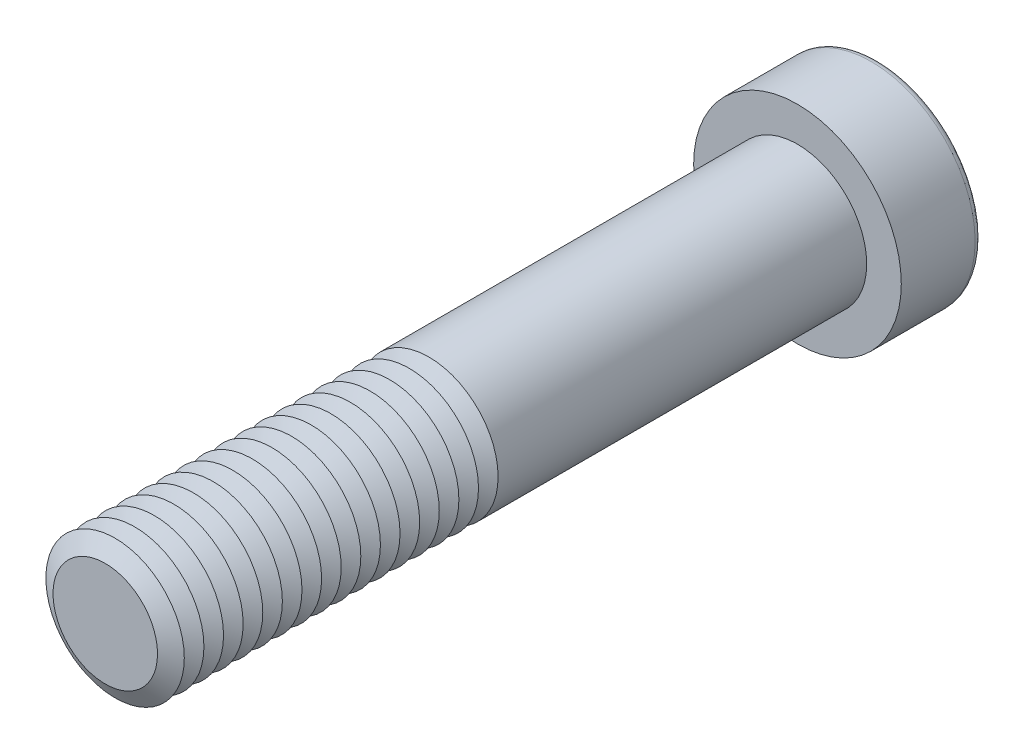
ISO-10303-21;
HEADER;
FILE_DESCRIPTION(('STEP AP214'),'2;1');
FILE_NAME('part.step','',(''),(''),'','','');
FILE_SCHEMA(('AUTOMOTIVE_DESIGN { 1 0 10303 214 1 1 1 1 }'));
ENDSEC;
DATA;
#1=APPLICATION_CONTEXT('core data for automotive mechanical design processes');
#2=APPLICATION_PROTOCOL_DEFINITION('international standard','automotive_design',2000,#1);
#3=PRODUCT_CONTEXT('',#1,'mechanical');
#4=PRODUCT('Part','Part','',(#3));
#5=PRODUCT_RELATED_PRODUCT_CATEGORY('part','',(#4));
#6=PRODUCT_DEFINITION_FORMATION('','',#4);
#7=PRODUCT_DEFINITION_CONTEXT('part definition',#1,'design');
#8=PRODUCT_DEFINITION('design','',#6,#7);
#9=PRODUCT_DEFINITION_SHAPE('','',#8);
#10=(LENGTH_UNIT() NAMED_UNIT(*) SI_UNIT(.MILLI.,.METRE.));
#11=(NAMED_UNIT(*) PLANE_ANGLE_UNIT() SI_UNIT($,.RADIAN.));
#12=(NAMED_UNIT(*) SI_UNIT($,.STERADIAN.) SOLID_ANGLE_UNIT());
#13=UNCERTAINTY_MEASURE_WITH_UNIT(LENGTH_MEASURE(1.E-05),#10,'distance_accuracy_value','');
#14=(GEOMETRIC_REPRESENTATION_CONTEXT(3) GLOBAL_UNCERTAINTY_ASSIGNED_CONTEXT((#13)) GLOBAL_UNIT_ASSIGNED_CONTEXT((#10,
#11,#12)) REPRESENTATION_CONTEXT('',''));
#15=CARTESIAN_POINT('',(0.,0.,0.));
#16=DIRECTION('',(0.,0.,1.));
#17=DIRECTION('',(1.,0.,0.));
#18=AXIS2_PLACEMENT_3D('',#15,#16,#17);
#19=CARTESIAN_POINT('',(0.,0.,54.05));
#20=DIRECTION('',(0.,0.,1.));
#21=DIRECTION('',(1.,0.,0.));
#22=AXIS2_PLACEMENT_3D('',#19,#20,#21);
#23=CONICAL_SURFACE('',#22,6.,1.0471975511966);
#24=CARTESIAN_POINT('',(0.,0.,53.2));
#25=DIRECTION('',(0.,0.,1.));
#26=DIRECTION('',(1.,0.,0.));
#27=AXIS2_PLACEMENT_3D('',#24,#25,#26);
#28=CIRCLE('',#27,4.52775681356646);
#29=CARTESIAN_POINT('',(4.52775681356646,0.,53.2));
#30=VERTEX_POINT('',#29);
#31=EDGE_CURVE('E314',#30,#30,#28,.T.);
#32=ORIENTED_EDGE('',*,*,#31,.T.);
#33=EDGE_LOOP('',(#32));
#34=FACE_BOUND('',#33,.T.);
#35=CARTESIAN_POINT('',(0.,0.,54.05));
#36=DIRECTION('',(0.,0.,1.));
#37=DIRECTION('',(1.,0.,0.));
#38=AXIS2_PLACEMENT_3D('',#35,#36,#37);
#39=CIRCLE('',#38,6.);
#40=CARTESIAN_POINT('',(6.,0.,54.05));
#41=VERTEX_POINT('',#40);
#42=EDGE_CURVE('E317',#41,#41,#39,.T.);
#43=ORIENTED_EDGE('',*,*,#42,.F.);
#44=EDGE_LOOP('',(#43));
#45=FACE_BOUND('',#44,.T.);
#46=ADVANCED_FACE('F39',(#34,#45),#23,.T.);
#47=CARTESIAN_POINT('',(0.,0.,53.2));
#48=DIRECTION('',(0.,0.,-1.));
#49=DIRECTION('',(-1.,0.,0.));
#50=AXIS2_PLACEMENT_3D('',#47,#48,#49);
#51=CONICAL_SURFACE('',#50,4.52775681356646,1.0471975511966);
#52=CARTESIAN_POINT('',(0.,0.,52.35));
#53=DIRECTION('',(0.,0.,1.));
#54=DIRECTION('',(1.,0.,0.));
#55=AXIS2_PLACEMENT_3D('',#52,#53,#54);
#56=CIRCLE('',#55,6.);
#57=CARTESIAN_POINT('',(6.,0.,52.35));
#58=VERTEX_POINT('',#57);
#59=EDGE_CURVE('E325',#58,#58,#56,.T.);
#60=ORIENTED_EDGE('',*,*,#59,.T.);
#61=EDGE_LOOP('',(#60));
#62=FACE_BOUND('',#61,.T.);
#63=ORIENTED_EDGE('',*,*,#31,.F.);
#64=EDGE_LOOP('',(#63));
#65=FACE_BOUND('',#64,.T.);
#66=ADVANCED_FACE('F245',(#62,#65),#51,.T.);
#67=CARTESIAN_POINT('',(0.,0.,60.));
#68=DIRECTION('',(0.,0.,1.));
#69=DIRECTION('',(1.,0.,0.));
#70=AXIS2_PLACEMENT_3D('',#67,#68,#69);
#71=PLANE('',#70);
#72=CARTESIAN_POINT('',(0.,0.,60.));
#73=DIRECTION('',(0.,0.,1.));
#74=DIRECTION('',(1.,0.,0.));
#75=AXIS2_PLACEMENT_3D('',#72,#73,#74);
#76=CIRCLE('',#75,4.52775681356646);
#77=CARTESIAN_POINT('',(4.52775681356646,0.,60.));
#78=VERTEX_POINT('',#77);
#79=EDGE_CURVE('E174',#78,#78,#76,.T.);
#80=ORIENTED_EDGE('',*,*,#79,.T.);
#81=EDGE_LOOP('',(#80));
#82=FACE_BOUND('',#81,.T.);
#83=ADVANCED_FACE('F251',(#82),#71,.T.);
#84=CARTESIAN_POINT('',(0.,0.,60.));
#85=DIRECTION('',(0.,0.,-1.));
#86=DIRECTION('',(-1.,0.,0.));
#87=AXIS2_PLACEMENT_3D('',#84,#85,#86);
#88=CONICAL_SURFACE('',#87,4.52775681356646,1.0471975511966);
#89=CARTESIAN_POINT('',(0.,0.,59.15));
#90=DIRECTION('',(0.,0.,1.));
#91=DIRECTION('',(1.,0.,0.));
#92=AXIS2_PLACEMENT_3D('',#89,#90,#91);
#93=CIRCLE('',#92,6.);
#94=CARTESIAN_POINT('',(6.,0.,59.15));
#95=VERTEX_POINT('',#94);
#96=EDGE_CURVE('E291',#95,#95,#93,.T.);
#97=ORIENTED_EDGE('',*,*,#96,.T.);
#98=EDGE_LOOP('',(#97));
#99=FACE_BOUND('',#98,.T.);
#100=ORIENTED_EDGE('',*,*,#79,.F.);
#101=EDGE_LOOP('',(#100));
#102=FACE_BOUND('',#101,.T.);
#103=ADVANCED_FACE('F199',(#99,#102),#88,.T.);
#104=CARTESIAN_POINT('',(0.,0.,59.15));
#105=DIRECTION('',(0.,0.,1.));
#106=DIRECTION('',(1.,0.,0.));
#107=AXIS2_PLACEMENT_3D('',#104,#105,#106);
#108=CONICAL_SURFACE('',#107,6.,1.0471975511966);
#109=CARTESIAN_POINT('',(0.,0.,58.3));
#110=DIRECTION('',(0.,0.,1.));
#111=DIRECTION('',(1.,0.,0.));
#112=AXIS2_PLACEMENT_3D('',#109,#110,#111);
#113=CIRCLE('',#112,4.52775681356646);
#114=CARTESIAN_POINT('',(4.52775681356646,0.,58.3));
#115=VERTEX_POINT('',#114);
#116=EDGE_CURVE('E288',#115,#115,#113,.T.);
#117=ORIENTED_EDGE('',*,*,#116,.T.);
#118=EDGE_LOOP('',(#117));
#119=FACE_BOUND('',#118,.T.);
#120=ORIENTED_EDGE('',*,*,#96,.F.);
#121=EDGE_LOOP('',(#120));
#122=FACE_BOUND('',#121,.T.);
#123=ADVANCED_FACE('F277',(#119,#122),#108,.T.);
#124=CARTESIAN_POINT('',(0.,0.,58.3));
#125=DIRECTION('',(0.,0.,-1.));
#126=DIRECTION('',(-1.,0.,0.));
#127=AXIS2_PLACEMENT_3D('',#124,#125,#126);
#128=CONICAL_SURFACE('',#127,4.52775681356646,1.0471975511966);
#129=CARTESIAN_POINT('',(0.,0.,57.45));
#130=DIRECTION('',(0.,0.,1.));
#131=DIRECTION('',(1.,0.,0.));
#132=AXIS2_PLACEMENT_3D('',#129,#130,#131);
#133=CIRCLE('',#132,6.);
#134=CARTESIAN_POINT('',(6.,0.,57.45));
#135=VERTEX_POINT('',#134);
#136=EDGE_CURVE('E300',#135,#135,#133,.T.);
#137=ORIENTED_EDGE('',*,*,#136,.T.);
#138=EDGE_LOOP('',(#137));
#139=FACE_BOUND('',#138,.T.);
#140=ORIENTED_EDGE('',*,*,#116,.F.);
#141=EDGE_LOOP('',(#140));
#142=FACE_BOUND('',#141,.T.);
#143=ADVANCED_FACE('F274',(#139,#142),#128,.T.);
#144=CARTESIAN_POINT('',(0.,0.,57.45));
#145=DIRECTION('',(0.,0.,1.));
#146=DIRECTION('',(1.,0.,0.));
#147=AXIS2_PLACEMENT_3D('',#144,#145,#146);
#148=CONICAL_SURFACE('',#147,6.,1.0471975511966);
#149=CARTESIAN_POINT('',(0.,0.,56.6));
#150=DIRECTION('',(0.,0.,1.));
#151=DIRECTION('',(1.,0.,0.));
#152=AXIS2_PLACEMENT_3D('',#149,#150,#151);
#153=CIRCLE('',#152,4.52775681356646);
#154=CARTESIAN_POINT('',(4.52775681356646,0.,56.6));
#155=VERTEX_POINT('',#154);
#156=EDGE_CURVE('E293',#155,#155,#153,.T.);
#157=ORIENTED_EDGE('',*,*,#156,.T.);
#158=EDGE_LOOP('',(#157));
#159=FACE_BOUND('',#158,.T.);
#160=ORIENTED_EDGE('',*,*,#136,.F.);
#161=EDGE_LOOP('',(#160));
#162=FACE_BOUND('',#161,.T.);
#163=ADVANCED_FACE('F270',(#159,#162),#148,.T.);
#164=CARTESIAN_POINT('',(0.,0.,56.6));
#165=DIRECTION('',(0.,0.,-1.));
#166=DIRECTION('',(-1.,0.,0.));
#167=AXIS2_PLACEMENT_3D('',#164,#165,#166);
#168=CONICAL_SURFACE('',#167,4.52775681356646,1.0471975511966);
#169=CARTESIAN_POINT('',(0.,0.,55.75));
#170=DIRECTION('',(0.,0.,1.));
#171=DIRECTION('',(1.,0.,0.));
#172=AXIS2_PLACEMENT_3D('',#169,#170,#171);
#173=CIRCLE('',#172,6.);
#174=CARTESIAN_POINT('',(6.,0.,55.75));
#175=VERTEX_POINT('',#174);
#176=EDGE_CURVE('E310',#175,#175,#173,.T.);
#177=ORIENTED_EDGE('',*,*,#176,.T.);
#178=EDGE_LOOP('',(#177));
#179=FACE_BOUND('',#178,.T.);
#180=ORIENTED_EDGE('',*,*,#156,.F.);
#181=EDGE_LOOP('',(#180));
#182=FACE_BOUND('',#181,.T.);
#183=ADVANCED_FACE('F266',(#179,#182),#168,.T.);
#184=CARTESIAN_POINT('',(0.,0.,55.75));
#185=DIRECTION('',(0.,0.,1.));
#186=DIRECTION('',(1.,0.,0.));
#187=AXIS2_PLACEMENT_3D('',#184,#185,#186);
#188=CONICAL_SURFACE('',#187,6.,1.0471975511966);
#189=CARTESIAN_POINT('',(0.,0.,54.9));
#190=DIRECTION('',(0.,0.,1.));
#191=DIRECTION('',(1.,0.,0.));
#192=AXIS2_PLACEMENT_3D('',#189,#190,#191);
#193=CIRCLE('',#192,4.52775681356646);
#194=CARTESIAN_POINT('',(4.52775681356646,0.,54.9));
#195=VERTEX_POINT('',#194);
#196=EDGE_CURVE('E306',#195,#195,#193,.T.);
#197=ORIENTED_EDGE('',*,*,#196,.T.);
#198=EDGE_LOOP('',(#197));
#199=FACE_BOUND('',#198,.T.);
#200=ORIENTED_EDGE('',*,*,#176,.F.);
#201=EDGE_LOOP('',(#200));
#202=FACE_BOUND('',#201,.T.);
#203=ADVANCED_FACE('F262',(#199,#202),#188,.T.);
#204=CARTESIAN_POINT('',(0.,0.,54.9));
#205=DIRECTION('',(0.,0.,-1.));
#206=DIRECTION('',(-1.,0.,0.));
#207=AXIS2_PLACEMENT_3D('',#204,#205,#206);
#208=CONICAL_SURFACE('',#207,4.52775681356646,1.0471975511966);
#209=ORIENTED_EDGE('',*,*,#42,.T.);
#210=EDGE_LOOP('',(#209));
#211=FACE_BOUND('',#210,.T.);
#212=ORIENTED_EDGE('',*,*,#196,.F.);
#213=EDGE_LOOP('',(#212));
#214=FACE_BOUND('',#213,.T.);
#215=ADVANCED_FACE('F258',(#211,#214),#208,.T.);
#216=CARTESIAN_POINT('',(0.,0.,52.35));
#217=DIRECTION('',(0.,0.,1.));
#218=DIRECTION('',(1.,0.,0.));
#219=AXIS2_PLACEMENT_3D('',#216,#217,#218);
#220=CONICAL_SURFACE('',#219,6.,1.0471975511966);
#221=CARTESIAN_POINT('',(0.,0.,51.5));
#222=DIRECTION('',(0.,0.,1.));
#223=DIRECTION('',(1.,0.,0.));
#224=AXIS2_PLACEMENT_3D('',#221,#222,#223);
#225=CIRCLE('',#224,4.52775681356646);
#226=CARTESIAN_POINT('',(4.52775681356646,0.,51.5));
#227=VERTEX_POINT('',#226);
#228=EDGE_CURVE('E321',#227,#227,#225,.T.);
#229=ORIENTED_EDGE('',*,*,#228,.T.);
#230=EDGE_LOOP('',(#229));
#231=FACE_BOUND('',#230,.T.);
#232=ORIENTED_EDGE('',*,*,#59,.F.);
#233=EDGE_LOOP('',(#232));
#234=FACE_BOUND('',#233,.T.);
#235=ADVANCED_FACE('F261',(#231,#234),#220,.T.);
#236=CARTESIAN_POINT('',(0.,0.,51.5));
#237=DIRECTION('',(0.,0.,-1.));
#238=DIRECTION('',(-1.,0.,0.));
#239=AXIS2_PLACEMENT_3D('',#236,#237,#238);
#240=CONICAL_SURFACE('',#239,4.52775681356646,1.0471975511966);
#241=CARTESIAN_POINT('',(0.,0.,50.65));
#242=DIRECTION('',(0.,0.,1.));
#243=DIRECTION('',(1.,0.,0.));
#244=AXIS2_PLACEMENT_3D('',#241,#242,#243);
#245=CIRCLE('',#244,6.);
#246=CARTESIAN_POINT('',(6.,0.,50.65));
#247=VERTEX_POINT('',#246);
#248=EDGE_CURVE('E332',#247,#247,#245,.T.);
#249=ORIENTED_EDGE('',*,*,#248,.T.);
#250=EDGE_LOOP('',(#249));
#251=FACE_BOUND('',#250,.T.);
#252=ORIENTED_EDGE('',*,*,#228,.F.);
#253=EDGE_LOOP('',(#252));
#254=FACE_BOUND('',#253,.T.);
#255=ADVANCED_FACE('F513',(#251,#254),#240,.T.);
#256=CARTESIAN_POINT('',(0.,0.,50.65));
#257=DIRECTION('',(0.,0.,1.));
#258=DIRECTION('',(1.,0.,0.));
#259=AXIS2_PLACEMENT_3D('',#256,#257,#258);
#260=CONICAL_SURFACE('',#259,6.,1.0471975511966);
#261=CARTESIAN_POINT('',(0.,0.,49.8));
#262=DIRECTION('',(0.,0.,1.));
#263=DIRECTION('',(1.,0.,0.));
#264=AXIS2_PLACEMENT_3D('',#261,#262,#263);
#265=CIRCLE('',#264,4.52775681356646);
#266=CARTESIAN_POINT('',(4.52775681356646,0.,49.8));
#267=VERTEX_POINT('',#266);
#268=EDGE_CURVE('E329',#267,#267,#265,.T.);
#269=ORIENTED_EDGE('',*,*,#268,.T.);
#270=EDGE_LOOP('',(#269));
#271=FACE_BOUND('',#270,.T.);
#272=ORIENTED_EDGE('',*,*,#248,.F.);
#273=EDGE_LOOP('',(#272));
#274=FACE_BOUND('',#273,.T.);
#275=ADVANCED_FACE('F509',(#271,#274),#260,.T.);
#276=CARTESIAN_POINT('',(0.,0.,49.8));
#277=DIRECTION('',(0.,0.,-1.));
#278=DIRECTION('',(-1.,0.,0.));
#279=AXIS2_PLACEMENT_3D('',#276,#277,#278);
#280=CONICAL_SURFACE('',#279,4.52775681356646,1.0471975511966);
#281=CARTESIAN_POINT('',(0.,0.,48.95));
#282=DIRECTION('',(0.,0.,1.));
#283=DIRECTION('',(1.,0.,0.));
#284=AXIS2_PLACEMENT_3D('',#281,#282,#283);
#285=CIRCLE('',#284,6.);
#286=CARTESIAN_POINT('',(6.,0.,48.95));
#287=VERTEX_POINT('',#286);
#288=EDGE_CURVE('E340',#287,#287,#285,.T.);
#289=ORIENTED_EDGE('',*,*,#288,.T.);
#290=EDGE_LOOP('',(#289));
#291=FACE_BOUND('',#290,.T.);
#292=ORIENTED_EDGE('',*,*,#268,.F.);
#293=EDGE_LOOP('',(#292));
#294=FACE_BOUND('',#293,.T.);
#295=ADVANCED_FACE('F505',(#291,#294),#280,.T.);
#296=CARTESIAN_POINT('',(0.,0.,48.95));
#297=DIRECTION('',(0.,0.,1.));
#298=DIRECTION('',(1.,0.,0.));
#299=AXIS2_PLACEMENT_3D('',#296,#297,#298);
#300=CONICAL_SURFACE('',#299,6.,1.0471975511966);
#301=CARTESIAN_POINT('',(0.,0.,48.1));
#302=DIRECTION('',(0.,0.,1.));
#303=DIRECTION('',(1.,0.,0.));
#304=AXIS2_PLACEMENT_3D('',#301,#302,#303);
#305=CIRCLE('',#304,4.52775681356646);
#306=CARTESIAN_POINT('',(4.52775681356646,0.,48.1));
#307=VERTEX_POINT('',#306);
#308=EDGE_CURVE('E336',#307,#307,#305,.T.);
#309=ORIENTED_EDGE('',*,*,#308,.T.);
#310=EDGE_LOOP('',(#309));
#311=FACE_BOUND('',#310,.T.);
#312=ORIENTED_EDGE('',*,*,#288,.F.);
#313=EDGE_LOOP('',(#312));
#314=FACE_BOUND('',#313,.T.);
#315=ADVANCED_FACE('F501',(#311,#314),#300,.T.);
#316=CARTESIAN_POINT('',(0.,0.,48.1));
#317=DIRECTION('',(0.,0.,-1.));
#318=DIRECTION('',(-1.,0.,0.));
#319=AXIS2_PLACEMENT_3D('',#316,#317,#318);
#320=CONICAL_SURFACE('',#319,4.52775681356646,1.0471975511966);
#321=CARTESIAN_POINT('',(0.,0.,47.25));
#322=DIRECTION('',(0.,0.,1.));
#323=DIRECTION('',(1.,0.,0.));
#324=AXIS2_PLACEMENT_3D('',#321,#322,#323);
#325=CIRCLE('',#324,6.);
#326=CARTESIAN_POINT('',(6.,0.,47.25));
#327=VERTEX_POINT('',#326);
#328=EDGE_CURVE('E348',#327,#327,#325,.T.);
#329=ORIENTED_EDGE('',*,*,#328,.T.);
#330=EDGE_LOOP('',(#329));
#331=FACE_BOUND('',#330,.T.);
#332=ORIENTED_EDGE('',*,*,#308,.F.);
#333=EDGE_LOOP('',(#332));
#334=FACE_BOUND('',#333,.T.);
#335=ADVANCED_FACE('F497',(#331,#334),#320,.T.);
#336=CARTESIAN_POINT('',(0.,0.,47.25));
#337=DIRECTION('',(0.,0.,1.));
#338=DIRECTION('',(1.,0.,0.));
#339=AXIS2_PLACEMENT_3D('',#336,#337,#338);
#340=CONICAL_SURFACE('',#339,6.,1.0471975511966);
#341=CARTESIAN_POINT('',(0.,0.,46.4));
#342=DIRECTION('',(0.,0.,1.));
#343=DIRECTION('',(1.,0.,0.));
#344=AXIS2_PLACEMENT_3D('',#341,#342,#343);
#345=CIRCLE('',#344,4.52775681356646);
#346=CARTESIAN_POINT('',(4.52775681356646,0.,46.4));
#347=VERTEX_POINT('',#346);
#348=EDGE_CURVE('E344',#347,#347,#345,.T.);
#349=ORIENTED_EDGE('',*,*,#348,.T.);
#350=EDGE_LOOP('',(#349));
#351=FACE_BOUND('',#350,.T.);
#352=ORIENTED_EDGE('',*,*,#328,.F.);
#353=EDGE_LOOP('',(#352));
#354=FACE_BOUND('',#353,.T.);
#355=ADVANCED_FACE('F493',(#351,#354),#340,.T.);
#356=CARTESIAN_POINT('',(0.,0.,46.4));
#357=DIRECTION('',(0.,0.,-1.));
#358=DIRECTION('',(-1.,0.,0.));
#359=AXIS2_PLACEMENT_3D('',#356,#357,#358);
#360=CONICAL_SURFACE('',#359,4.52775681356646,1.0471975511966);
#361=CARTESIAN_POINT('',(0.,0.,45.55));
#362=DIRECTION('',(0.,0.,1.));
#363=DIRECTION('',(1.,0.,0.));
#364=AXIS2_PLACEMENT_3D('',#361,#362,#363);
#365=CIRCLE('',#364,6.);
#366=CARTESIAN_POINT('',(6.,0.,45.55));
#367=VERTEX_POINT('',#366);
#368=EDGE_CURVE('E356',#367,#367,#365,.T.);
#369=ORIENTED_EDGE('',*,*,#368,.T.);
#370=EDGE_LOOP('',(#369));
#371=FACE_BOUND('',#370,.T.);
#372=ORIENTED_EDGE('',*,*,#348,.F.);
#373=EDGE_LOOP('',(#372));
#374=FACE_BOUND('',#373,.T.);
#375=ADVANCED_FACE('F489',(#371,#374),#360,.T.);
#376=CARTESIAN_POINT('',(0.,0.,45.55));
#377=DIRECTION('',(0.,0.,1.));
#378=DIRECTION('',(1.,0.,0.));
#379=AXIS2_PLACEMENT_3D('',#376,#377,#378);
#380=CONICAL_SURFACE('',#379,6.,1.0471975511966);
#381=CARTESIAN_POINT('',(0.,0.,44.7));
#382=DIRECTION('',(0.,0.,1.));
#383=DIRECTION('',(1.,0.,0.));
#384=AXIS2_PLACEMENT_3D('',#381,#382,#383);
#385=CIRCLE('',#384,4.52775681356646);
#386=CARTESIAN_POINT('',(4.52775681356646,0.,44.7));
#387=VERTEX_POINT('',#386);
#388=EDGE_CURVE('E352',#387,#387,#385,.T.);
#389=ORIENTED_EDGE('',*,*,#388,.T.);
#390=EDGE_LOOP('',(#389));
#391=FACE_BOUND('',#390,.T.);
#392=ORIENTED_EDGE('',*,*,#368,.F.);
#393=EDGE_LOOP('',(#392));
#394=FACE_BOUND('',#393,.T.);
#395=ADVANCED_FACE('F485',(#391,#394),#380,.T.);
#396=CARTESIAN_POINT('',(0.,0.,44.7));
#397=DIRECTION('',(0.,0.,-1.));
#398=DIRECTION('',(-1.,0.,0.));
#399=AXIS2_PLACEMENT_3D('',#396,#397,#398);
#400=CONICAL_SURFACE('',#399,4.52775681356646,1.0471975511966);
#401=CARTESIAN_POINT('',(0.,0.,43.85));
#402=DIRECTION('',(0.,0.,1.));
#403=DIRECTION('',(1.,0.,0.));
#404=AXIS2_PLACEMENT_3D('',#401,#402,#403);
#405=CIRCLE('',#404,6.);
#406=CARTESIAN_POINT('',(6.,0.,43.85));
#407=VERTEX_POINT('',#406);
#408=EDGE_CURVE('E364',#407,#407,#405,.T.);
#409=ORIENTED_EDGE('',*,*,#408,.T.);
#410=EDGE_LOOP('',(#409));
#411=FACE_BOUND('',#410,.T.);
#412=ORIENTED_EDGE('',*,*,#388,.F.);
#413=EDGE_LOOP('',(#412));
#414=FACE_BOUND('',#413,.T.);
#415=ADVANCED_FACE('F481',(#411,#414),#400,.T.);
#416=CARTESIAN_POINT('',(0.,0.,43.85));
#417=DIRECTION('',(0.,0.,1.));
#418=DIRECTION('',(1.,0.,0.));
#419=AXIS2_PLACEMENT_3D('',#416,#417,#418);
#420=CONICAL_SURFACE('',#419,6.,1.0471975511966);
#421=CARTESIAN_POINT('',(0.,0.,43.));
#422=DIRECTION('',(0.,0.,1.));
#423=DIRECTION('',(1.,0.,0.));
#424=AXIS2_PLACEMENT_3D('',#421,#422,#423);
#425=CIRCLE('',#424,4.52775681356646);
#426=CARTESIAN_POINT('',(4.52775681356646,0.,43.));
#427=VERTEX_POINT('',#426);
#428=EDGE_CURVE('E360',#427,#427,#425,.T.);
#429=ORIENTED_EDGE('',*,*,#428,.T.);
#430=EDGE_LOOP('',(#429));
#431=FACE_BOUND('',#430,.T.);
#432=ORIENTED_EDGE('',*,*,#408,.F.);
#433=EDGE_LOOP('',(#432));
#434=FACE_BOUND('',#433,.T.);
#435=ADVANCED_FACE('F477',(#431,#434),#420,.T.);
#436=CARTESIAN_POINT('',(0.,0.,43.));
#437=DIRECTION('',(0.,0.,-1.));
#438=DIRECTION('',(-1.,0.,0.));
#439=AXIS2_PLACEMENT_3D('',#436,#437,#438);
#440=CONICAL_SURFACE('',#439,4.52775681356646,1.0471975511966);
#441=CARTESIAN_POINT('',(0.,0.,42.15));
#442=DIRECTION('',(0.,0.,1.));
#443=DIRECTION('',(1.,0.,0.));
#444=AXIS2_PLACEMENT_3D('',#441,#442,#443);
#445=CIRCLE('',#444,6.);
#446=CARTESIAN_POINT('',(6.,0.,42.15));
#447=VERTEX_POINT('',#446);
#448=EDGE_CURVE('E372',#447,#447,#445,.T.);
#449=ORIENTED_EDGE('',*,*,#448,.T.);
#450=EDGE_LOOP('',(#449));
#451=FACE_BOUND('',#450,.T.);
#452=ORIENTED_EDGE('',*,*,#428,.F.);
#453=EDGE_LOOP('',(#452));
#454=FACE_BOUND('',#453,.T.);
#455=ADVANCED_FACE('F473',(#451,#454),#440,.T.);
#456=CARTESIAN_POINT('',(0.,0.,42.15));
#457=DIRECTION('',(0.,0.,1.));
#458=DIRECTION('',(1.,0.,0.));
#459=AXIS2_PLACEMENT_3D('',#456,#457,#458);
#460=CONICAL_SURFACE('',#459,6.,1.0471975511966);
#461=CARTESIAN_POINT('',(0.,0.,41.3));
#462=DIRECTION('',(0.,0.,1.));
#463=DIRECTION('',(1.,0.,0.));
#464=AXIS2_PLACEMENT_3D('',#461,#462,#463);
#465=CIRCLE('',#464,4.52775681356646);
#466=CARTESIAN_POINT('',(4.52775681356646,0.,41.3));
#467=VERTEX_POINT('',#466);
#468=EDGE_CURVE('E368',#467,#467,#465,.T.);
#469=ORIENTED_EDGE('',*,*,#468,.T.);
#470=EDGE_LOOP('',(#469));
#471=FACE_BOUND('',#470,.T.);
#472=ORIENTED_EDGE('',*,*,#448,.F.);
#473=EDGE_LOOP('',(#472));
#474=FACE_BOUND('',#473,.T.);
#475=ADVANCED_FACE('F469',(#471,#474),#460,.T.);
#476=CARTESIAN_POINT('',(0.,0.,41.3));
#477=DIRECTION('',(0.,0.,-1.));
#478=DIRECTION('',(-1.,0.,0.));
#479=AXIS2_PLACEMENT_3D('',#476,#477,#478);
#480=CONICAL_SURFACE('',#479,4.52775681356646,1.0471975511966);
#481=CARTESIAN_POINT('',(0.,0.,40.45));
#482=DIRECTION('',(0.,0.,1.));
#483=DIRECTION('',(1.,0.,0.));
#484=AXIS2_PLACEMENT_3D('',#481,#482,#483);
#485=CIRCLE('',#484,6.);
#486=CARTESIAN_POINT('',(6.,0.,40.45));
#487=VERTEX_POINT('',#486);
#488=EDGE_CURVE('E380',#487,#487,#485,.T.);
#489=ORIENTED_EDGE('',*,*,#488,.T.);
#490=EDGE_LOOP('',(#489));
#491=FACE_BOUND('',#490,.T.);
#492=ORIENTED_EDGE('',*,*,#468,.F.);
#493=EDGE_LOOP('',(#492));
#494=FACE_BOUND('',#493,.T.);
#495=ADVANCED_FACE('F465',(#491,#494),#480,.T.);
#496=CARTESIAN_POINT('',(0.,0.,40.45));
#497=DIRECTION('',(0.,0.,1.));
#498=DIRECTION('',(1.,0.,0.));
#499=AXIS2_PLACEMENT_3D('',#496,#497,#498);
#500=CONICAL_SURFACE('',#499,6.,1.0471975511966);
#501=CARTESIAN_POINT('',(0.,0.,39.6));
#502=DIRECTION('',(0.,0.,1.));
#503=DIRECTION('',(1.,0.,0.));
#504=AXIS2_PLACEMENT_3D('',#501,#502,#503);
#505=CIRCLE('',#504,4.52775681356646);
#506=CARTESIAN_POINT('',(4.52775681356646,0.,39.6));
#507=VERTEX_POINT('',#506);
#508=EDGE_CURVE('E376',#507,#507,#505,.T.);
#509=ORIENTED_EDGE('',*,*,#508,.T.);
#510=EDGE_LOOP('',(#509));
#511=FACE_BOUND('',#510,.T.);
#512=ORIENTED_EDGE('',*,*,#488,.F.);
#513=EDGE_LOOP('',(#512));
#514=FACE_BOUND('',#513,.T.);
#515=ADVANCED_FACE('F461',(#511,#514),#500,.T.);
#516=CARTESIAN_POINT('',(0.,0.,39.6));
#517=DIRECTION('',(0.,0.,-1.));
#518=DIRECTION('',(-1.,0.,0.));
#519=AXIS2_PLACEMENT_3D('',#516,#517,#518);
#520=CONICAL_SURFACE('',#519,4.52775681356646,1.0471975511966);
#521=CARTESIAN_POINT('',(0.,0.,38.75));
#522=DIRECTION('',(0.,0.,1.));
#523=DIRECTION('',(1.,0.,0.));
#524=AXIS2_PLACEMENT_3D('',#521,#522,#523);
#525=CIRCLE('',#524,6.);
#526=CARTESIAN_POINT('',(6.,0.,38.75));
#527=VERTEX_POINT('',#526);
#528=EDGE_CURVE('E388',#527,#527,#525,.T.);
#529=ORIENTED_EDGE('',*,*,#528,.T.);
#530=EDGE_LOOP('',(#529));
#531=FACE_BOUND('',#530,.T.);
#532=ORIENTED_EDGE('',*,*,#508,.F.);
#533=EDGE_LOOP('',(#532));
#534=FACE_BOUND('',#533,.T.);
#535=ADVANCED_FACE('F457',(#531,#534),#520,.T.);
#536=CARTESIAN_POINT('',(0.,0.,38.75));
#537=DIRECTION('',(0.,0.,1.));
#538=DIRECTION('',(1.,0.,0.));
#539=AXIS2_PLACEMENT_3D('',#536,#537,#538);
#540=CONICAL_SURFACE('',#539,6.,1.0471975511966);
#541=CARTESIAN_POINT('',(0.,0.,37.9));
#542=DIRECTION('',(0.,0.,1.));
#543=DIRECTION('',(1.,0.,0.));
#544=AXIS2_PLACEMENT_3D('',#541,#542,#543);
#545=CIRCLE('',#544,4.52775681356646);
#546=CARTESIAN_POINT('',(4.52775681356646,0.,37.9));
#547=VERTEX_POINT('',#546);
#548=EDGE_CURVE('E384',#547,#547,#545,.T.);
#549=ORIENTED_EDGE('',*,*,#548,.T.);
#550=EDGE_LOOP('',(#549));
#551=FACE_BOUND('',#550,.T.);
#552=ORIENTED_EDGE('',*,*,#528,.F.);
#553=EDGE_LOOP('',(#552));
#554=FACE_BOUND('',#553,.T.);
#555=ADVANCED_FACE('F453',(#551,#554),#540,.T.);
#556=CARTESIAN_POINT('',(0.,0.,37.9));
#557=DIRECTION('',(0.,0.,-1.));
#558=DIRECTION('',(-1.,0.,0.));
#559=AXIS2_PLACEMENT_3D('',#556,#557,#558);
#560=CONICAL_SURFACE('',#559,4.52775681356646,1.0471975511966);
#561=CARTESIAN_POINT('',(0.,0.,37.05));
#562=DIRECTION('',(0.,0.,1.));
#563=DIRECTION('',(1.,0.,0.));
#564=AXIS2_PLACEMENT_3D('',#561,#562,#563);
#565=CIRCLE('',#564,6.);
#566=CARTESIAN_POINT('',(6.,0.,37.05));
#567=VERTEX_POINT('',#566);
#568=EDGE_CURVE('E396',#567,#567,#565,.T.);
#569=ORIENTED_EDGE('',*,*,#568,.T.);
#570=EDGE_LOOP('',(#569));
#571=FACE_BOUND('',#570,.T.);
#572=ORIENTED_EDGE('',*,*,#548,.F.);
#573=EDGE_LOOP('',(#572));
#574=FACE_BOUND('',#573,.T.);
#575=ADVANCED_FACE('F449',(#571,#574),#560,.T.);
#576=CARTESIAN_POINT('',(0.,0.,37.05));
#577=DIRECTION('',(0.,0.,1.));
#578=DIRECTION('',(1.,0.,0.));
#579=AXIS2_PLACEMENT_3D('',#576,#577,#578);
#580=CONICAL_SURFACE('',#579,6.,1.0471975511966);
#581=CARTESIAN_POINT('',(0.,0.,36.2));
#582=DIRECTION('',(0.,0.,1.));
#583=DIRECTION('',(1.,0.,0.));
#584=AXIS2_PLACEMENT_3D('',#581,#582,#583);
#585=CIRCLE('',#584,4.52775681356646);
#586=CARTESIAN_POINT('',(4.52775681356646,0.,36.2));
#587=VERTEX_POINT('',#586);
#588=EDGE_CURVE('E392',#587,#587,#585,.T.);
#589=ORIENTED_EDGE('',*,*,#588,.T.);
#590=EDGE_LOOP('',(#589));
#591=FACE_BOUND('',#590,.T.);
#592=ORIENTED_EDGE('',*,*,#568,.F.);
#593=EDGE_LOOP('',(#592));
#594=FACE_BOUND('',#593,.T.);
#595=ADVANCED_FACE('F445',(#591,#594),#580,.T.);
#596=CARTESIAN_POINT('',(0.,0.,36.2));
#597=DIRECTION('',(0.,0.,-1.));
#598=DIRECTION('',(-1.,0.,0.));
#599=AXIS2_PLACEMENT_3D('',#596,#597,#598);
#600=CONICAL_SURFACE('',#599,4.52775681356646,1.0471975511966);
#601=CARTESIAN_POINT('',(0.,0.,35.35));
#602=DIRECTION('',(0.,0.,1.));
#603=DIRECTION('',(1.,0.,0.));
#604=AXIS2_PLACEMENT_3D('',#601,#602,#603);
#605=CIRCLE('',#604,6.);
#606=CARTESIAN_POINT('',(6.,0.,35.35));
#607=VERTEX_POINT('',#606);
#608=EDGE_CURVE('E404',#607,#607,#605,.T.);
#609=ORIENTED_EDGE('',*,*,#608,.T.);
#610=EDGE_LOOP('',(#609));
#611=FACE_BOUND('',#610,.T.);
#612=ORIENTED_EDGE('',*,*,#588,.F.);
#613=EDGE_LOOP('',(#612));
#614=FACE_BOUND('',#613,.T.);
#615=ADVANCED_FACE('F441',(#611,#614),#600,.T.);
#616=CARTESIAN_POINT('',(0.,0.,35.35));
#617=DIRECTION('',(0.,0.,1.));
#618=DIRECTION('',(1.,0.,0.));
#619=AXIS2_PLACEMENT_3D('',#616,#617,#618);
#620=CONICAL_SURFACE('',#619,6.,1.0471975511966);
#621=CARTESIAN_POINT('',(0.,0.,34.5));
#622=DIRECTION('',(0.,0.,1.));
#623=DIRECTION('',(1.,0.,0.));
#624=AXIS2_PLACEMENT_3D('',#621,#622,#623);
#625=CIRCLE('',#624,4.52775681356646);
#626=CARTESIAN_POINT('',(4.52775681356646,0.,34.5));
#627=VERTEX_POINT('',#626);
#628=EDGE_CURVE('E400',#627,#627,#625,.T.);
#629=ORIENTED_EDGE('',*,*,#628,.T.);
#630=EDGE_LOOP('',(#629));
#631=FACE_BOUND('',#630,.T.);
#632=ORIENTED_EDGE('',*,*,#608,.F.);
#633=EDGE_LOOP('',(#632));
#634=FACE_BOUND('',#633,.T.);
#635=ADVANCED_FACE('F436',(#631,#634),#620,.T.);
#636=CARTESIAN_POINT('',(0.,0.,34.5));
#637=DIRECTION('',(0.,0.,-1.));
#638=DIRECTION('',(-1.,0.,0.));
#639=AXIS2_PLACEMENT_3D('',#636,#637,#638);
#640=CONICAL_SURFACE('',#639,4.52775681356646,1.0471975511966);
#641=CARTESIAN_POINT('',(0.,0.,33.65));
#642=DIRECTION('',(0.,0.,1.));
#643=DIRECTION('',(1.,0.,0.));
#644=AXIS2_PLACEMENT_3D('',#641,#642,#643);
#645=CIRCLE('',#644,6.);
#646=CARTESIAN_POINT('',(6.,0.,33.65));
#647=VERTEX_POINT('',#646);
#648=EDGE_CURVE('E416',#647,#647,#645,.T.);
#649=ORIENTED_EDGE('',*,*,#648,.T.);
#650=EDGE_LOOP('',(#649));
#651=FACE_BOUND('',#650,.T.);
#652=ORIENTED_EDGE('',*,*,#628,.F.);
#653=EDGE_LOOP('',(#652));
#654=FACE_BOUND('',#653,.T.);
#655=ADVANCED_FACE('F422',(#651,#654),#640,.T.);
#656=CARTESIAN_POINT('',(0.,0.,33.65));
#657=DIRECTION('',(0.,0.,1.));
#658=DIRECTION('',(1.,0.,0.));
#659=AXIS2_PLACEMENT_3D('',#656,#657,#658);
#660=CONICAL_SURFACE('',#659,6.,1.0471975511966);
#661=CARTESIAN_POINT('',(0.,0.,32.8));
#662=DIRECTION('',(0.,0.,1.));
#663=DIRECTION('',(1.,0.,0.));
#664=AXIS2_PLACEMENT_3D('',#661,#662,#663);
#665=CIRCLE('',#664,4.52775681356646);
#666=CARTESIAN_POINT('',(4.52775681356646,0.,32.8));
#667=VERTEX_POINT('',#666);
#668=EDGE_CURVE('E408',#667,#667,#665,.T.);
#669=ORIENTED_EDGE('',*,*,#668,.T.);
#670=EDGE_LOOP('',(#669));
#671=FACE_BOUND('',#670,.T.);
#672=ORIENTED_EDGE('',*,*,#648,.F.);
#673=EDGE_LOOP('',(#672));
#674=FACE_BOUND('',#673,.T.);
#675=ADVANCED_FACE('F425',(#671,#674),#660,.T.);
#676=CARTESIAN_POINT('',(0.,0.,32.8));
#677=DIRECTION('',(0.,0.,-1.));
#678=DIRECTION('',(-1.,0.,0.));
#679=AXIS2_PLACEMENT_3D('',#676,#677,#678);
#680=CONICAL_SURFACE('',#679,4.52775681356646,1.0471975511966);
#681=CARTESIAN_POINT('',(0.,0.,31.95));
#682=DIRECTION('',(0.,0.,1.));
#683=DIRECTION('',(1.,0.,0.));
#684=AXIS2_PLACEMENT_3D('',#681,#682,#683);
#685=CIRCLE('',#684,6.);
#686=CARTESIAN_POINT('',(6.,0.,31.95));
#687=VERTEX_POINT('',#686);
#688=EDGE_CURVE('E412',#687,#687,#685,.T.);
#689=ORIENTED_EDGE('',*,*,#688,.T.);
#690=EDGE_LOOP('',(#689));
#691=FACE_BOUND('',#690,.T.);
#692=ORIENTED_EDGE('',*,*,#668,.F.);
#693=EDGE_LOOP('',(#692));
#694=FACE_BOUND('',#693,.T.);
#695=ADVANCED_FACE('F427',(#691,#694),#680,.T.);
#696=CARTESIAN_POINT('',(0.,0.,-1.));
#697=DIRECTION('',(0.,0.,-1.));
#698=DIRECTION('',(-1.,0.,0.));
#699=AXIS2_PLACEMENT_3D('',#696,#697,#698);
#700=CONICAL_SURFACE('',#699,4.,1.0471975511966);
#701=CARTESIAN_POINT('',(0.,0.,1.30940107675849));
#702=VERTEX_POINT('',#701);
#703=VERTEX_LOOP('',#702);
#704=FACE_BOUND('',#703,.T.);
#705=CARTESIAN_POINT('',(0.,0.,-1.));
#706=DIRECTION('',(0.,0.,-1.));
#707=DIRECTION('',(-1.,0.,0.));
#708=AXIS2_PLACEMENT_3D('',#705,#706,#707);
#709=CIRCLE('',#708,4.);
#710=CARTESIAN_POINT('',(-3.46410161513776,2.,-1.));
#711=VERTEX_POINT('',#710);
#712=CARTESIAN_POINT('',(0.,4.,-1.));
#713=VERTEX_POINT('',#712);
#714=EDGE_CURVE('E149',#711,#713,#709,.T.);
#715=ORIENTED_EDGE('',*,*,#714,.T.);
#716=CARTESIAN_POINT('',(0.,0.,-1.));
#717=DIRECTION('',(0.,0.,-1.));
#718=DIRECTION('',(-1.,0.,0.));
#719=AXIS2_PLACEMENT_3D('',#716,#717,#718);
#720=CIRCLE('',#719,4.);
#721=CARTESIAN_POINT('',(3.46410161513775,2.,-1.));
#722=VERTEX_POINT('',#721);
#723=EDGE_CURVE('E54',#713,#722,#720,.T.);
#724=ORIENTED_EDGE('',*,*,#723,.T.);
#725=CARTESIAN_POINT('',(3.46410161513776,-2.,-1.));
#726=VERTEX_POINT('',#725);
#727=EDGE_CURVE('E1025',#722,#726,#720,.T.);
#728=ORIENTED_EDGE('',*,*,#727,.T.);
#729=CARTESIAN_POINT('',(0.,-4.,-1.));
#730=VERTEX_POINT('',#729);
#731=EDGE_CURVE('E1024',#726,#730,#720,.T.);
#732=ORIENTED_EDGE('',*,*,#731,.T.);
#733=CARTESIAN_POINT('',(-3.46410161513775,-2.,-1.));
#734=VERTEX_POINT('',#733);
#735=EDGE_CURVE('E1019',#730,#734,#720,.T.);
#736=ORIENTED_EDGE('',*,*,#735,.T.);
#737=EDGE_CURVE('E1017',#734,#711,#720,.T.);
#738=ORIENTED_EDGE('',*,*,#737,.T.);
#739=EDGE_LOOP('',(#715,#724,#728,#732,#736,#738));
#740=FACE_BOUND('',#739,.T.);
#741=ADVANCED_FACE('F201',(#704,#740),#700,.F.);
#742=CARTESIAN_POINT('',(0.,0.,-1.));
#743=DIRECTION('',(0.,0.,-1.));
#744=DIRECTION('',(-1.,0.,0.));
#745=AXIS2_PLACEMENT_3D('',#742,#743,#744);
#746=PLANE('',#745);
#747=ORIENTED_EDGE('',*,*,#723,.F.);
#748=DIRECTION('',(1.,0.,0.));
#749=VECTOR('',#748,1.);
#750=CARTESIAN_POINT('',(-2.3094010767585,4.,-1.));
#751=LINE('',#750,#749);
#752=CARTESIAN_POINT('',(2.3094010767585,4.,-1.));
#753=VERTEX_POINT('',#752);
#754=EDGE_CURVE('E1065',#713,#753,#751,.T.);
#755=ORIENTED_EDGE('',*,*,#754,.T.);
#756=DIRECTION('',(0.5,-0.866025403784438,0.));
#757=VECTOR('',#756,1.);
#758=CARTESIAN_POINT('',(2.3094010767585,4.,-1.));
#759=LINE('',#758,#757);
#760=EDGE_CURVE('E155',#753,#722,#759,.T.);
#761=ORIENTED_EDGE('',*,*,#760,.T.);
#762=EDGE_LOOP('',(#747,#755,#761));
#763=FACE_BOUND('',#762,.T.);
#764=ADVANCED_FACE('F608',(#763),#746,.T.);
#765=ORIENTED_EDGE('',*,*,#727,.F.);
#766=CARTESIAN_POINT('',(4.61880215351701,0.,-1.));
#767=VERTEX_POINT('',#766);
#768=EDGE_CURVE('E1068',#722,#767,#759,.T.);
#769=ORIENTED_EDGE('',*,*,#768,.T.);
#770=DIRECTION('',(-0.5,-0.866025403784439,0.));
#771=VECTOR('',#770,1.);
#772=CARTESIAN_POINT('',(4.61880215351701,0.,-1.));
#773=LINE('',#772,#771);
#774=EDGE_CURVE('E1037',#767,#726,#773,.T.);
#775=ORIENTED_EDGE('',*,*,#774,.T.);
#776=EDGE_LOOP('',(#765,#769,#775));
#777=FACE_BOUND('',#776,.T.);
#778=ADVANCED_FACE('F618',(#777),#746,.T.);
#779=ORIENTED_EDGE('',*,*,#731,.F.);
#780=CARTESIAN_POINT('',(2.3094010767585,-4.,-1.));
#781=VERTEX_POINT('',#780);
#782=EDGE_CURVE('E1039',#726,#781,#773,.T.);
#783=ORIENTED_EDGE('',*,*,#782,.T.);
#784=DIRECTION('',(-1.,0.,0.));
#785=VECTOR('',#784,1.);
#786=CARTESIAN_POINT('',(2.3094010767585,-4.,-1.));
#787=LINE('',#786,#785);
#788=EDGE_CURVE('E994',#781,#730,#787,.T.);
#789=ORIENTED_EDGE('',*,*,#788,.T.);
#790=EDGE_LOOP('',(#779,#783,#789));
#791=FACE_BOUND('',#790,.T.);
#792=ADVANCED_FACE('F628',(#791),#746,.T.);
#793=ORIENTED_EDGE('',*,*,#735,.F.);
#794=CARTESIAN_POINT('',(-2.3094010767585,-4.,-1.));
#795=VERTEX_POINT('',#794);
#796=EDGE_CURVE('E1033',#730,#795,#787,.T.);
#797=ORIENTED_EDGE('',*,*,#796,.T.);
#798=DIRECTION('',(-0.5,0.866025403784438,0.));
#799=VECTOR('',#798,1.);
#800=CARTESIAN_POINT('',(-2.3094010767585,-4.,-1.));
#801=LINE('',#800,#799);
#802=EDGE_CURVE('E1035',#795,#734,#801,.T.);
#803=ORIENTED_EDGE('',*,*,#802,.T.);
#804=EDGE_LOOP('',(#793,#797,#803));
#805=FACE_BOUND('',#804,.T.);
#806=ADVANCED_FACE('F636',(#805),#746,.T.);
#807=ORIENTED_EDGE('',*,*,#737,.F.);
#808=CARTESIAN_POINT('',(-4.61880215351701,0.,-1.));
#809=VERTEX_POINT('',#808);
#810=EDGE_CURVE('E1041',#734,#809,#801,.T.);
#811=ORIENTED_EDGE('',*,*,#810,.T.);
#812=DIRECTION('',(0.5,0.866025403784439,0.));
#813=VECTOR('',#812,1.);
#814=CARTESIAN_POINT('',(-4.61880215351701,0.,-1.));
#815=LINE('',#814,#813);
#816=EDGE_CURVE('E158',#809,#711,#815,.T.);
#817=ORIENTED_EDGE('',*,*,#816,.T.);
#818=EDGE_LOOP('',(#807,#811,#817));
#819=FACE_BOUND('',#818,.T.);
#820=ADVANCED_FACE('F231',(#819),#746,.T.);
#821=ORIENTED_EDGE('',*,*,#714,.F.);
#822=CARTESIAN_POINT('',(-2.3094010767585,4.,-1.));
#823=VERTEX_POINT('',#822);
#824=EDGE_CURVE('E1048',#711,#823,#815,.T.);
#825=ORIENTED_EDGE('',*,*,#824,.T.);
#826=EDGE_CURVE('E1063',#823,#713,#751,.T.);
#827=ORIENTED_EDGE('',*,*,#826,.T.);
#828=EDGE_LOOP('',(#821,#825,#827));
#829=FACE_BOUND('',#828,.T.);
#830=ADVANCED_FACE('F620',(#829),#746,.T.);
#831=CARTESIAN_POINT('',(-2.3094010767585,4.,-1.));
#832=DIRECTION('',(0.,1.,0.));
#833=DIRECTION('',(0.,0.,1.));
#834=AXIS2_PLACEMENT_3D('',#831,#832,#833);
#835=PLANE('',#834);
#836=DIRECTION('',(0.,0.,-1.));
#837=VECTOR('',#836,1.);
#838=CARTESIAN_POINT('',(-2.3094010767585,4.,-1.));
#839=LINE('',#838,#837);
#840=CARTESIAN_POINT('',(-2.3094010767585,4.,-7.));
#841=VERTEX_POINT('',#840);
#842=EDGE_CURVE('E147',#823,#841,#839,.T.);
#843=ORIENTED_EDGE('',*,*,#842,.T.);
#844=CARTESIAN_POINT('',(-6.02881516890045,4.,-7.70103379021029));
#845=CARTESIAN_POINT('',(-5.8481958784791,4.,-7.66071709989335));
#846=CARTESIAN_POINT('',(-5.66746141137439,4.,-7.62090727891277));
#847=CARTESIAN_POINT('',(-5.30570552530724,4.,-7.54257487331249));
#848=CARTESIAN_POINT('',(-5.12468409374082,4.,-7.50405234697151));
#849=CARTESIAN_POINT('',(-4.76212658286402,4.,-7.42853268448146));
#850=CARTESIAN_POINT('',(-4.58059016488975,4.,-7.39153716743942));
#851=CARTESIAN_POINT('',(-4.21713405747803,4.,-7.31948392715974));
#852=CARTESIAN_POINT('',(-4.03521437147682,4.,-7.28442618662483));
#853=CARTESIAN_POINT('',(-3.67250657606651,4.,-7.21700168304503));
#854=CARTESIAN_POINT('',(-3.4917223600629,4.,-7.18461419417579));
#855=CARTESIAN_POINT('',(-3.12965653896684,4.,-7.12275774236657));
#856=CARTESIAN_POINT('',(-2.94837492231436,4.,-7.09328884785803));
#857=CARTESIAN_POINT('',(-2.40374454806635,4.,-7.01026455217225));
#858=CARTESIAN_POINT('',(-2.03952090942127,4.,-6.96207428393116));
#859=CARTESIAN_POINT('',(-1.48950033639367,4.,-6.90518200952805));
#860=CARTESIAN_POINT('',(-1.30450135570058,4.,-6.88873552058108));
#861=CARTESIAN_POINT('',(-0.934053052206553,4.,-6.86198845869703));
#862=CARTESIAN_POINT('',(-0.748603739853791,4.,-6.85168774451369));
#863=CARTESIAN_POINT('',(-0.377528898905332,4.,-6.83783090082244));
#864=CARTESIAN_POINT('',(-0.191903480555,4.,-6.83427186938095));
#865=CARTESIAN_POINT('',(0.179350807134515,4.,-6.83411569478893));
#866=CARTESIAN_POINT('',(0.364979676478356,4.,-6.83751856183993));
#867=CARTESIAN_POINT('',(0.736742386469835,4.,-6.85109802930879));
#868=CARTESIAN_POINT('',(0.922875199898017,4.,-6.86130219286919));
#869=CARTESIAN_POINT('',(1.29469888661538,4.,-6.8879135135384));
#870=CARTESIAN_POINT('',(1.48038973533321,4.,-6.90432100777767));
#871=CARTESIAN_POINT('',(1.85132520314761,4.,-6.94252995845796));
#872=CARTESIAN_POINT('',(2.036569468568,4.,-6.96433479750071));
#873=CARTESIAN_POINT('',(2.40646407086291,4.,-7.0124559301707));
#874=CARTESIAN_POINT('',(2.59111440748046,4.,-7.03877222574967));
#875=CARTESIAN_POINT('',(2.96467049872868,4.,-7.09583231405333));
#876=CARTESIAN_POINT('',(3.15356118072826,4.,-7.12667393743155));
#877=CARTESIAN_POINT('',(3.53080577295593,4.,-7.19148953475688));
#878=CARTESIAN_POINT('',(3.71915966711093,4.,-7.22546360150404));
#879=CARTESIAN_POINT('',(4.2835627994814,4.,-7.33112271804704));
#880=CARTESIAN_POINT('',(4.65891157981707,4.,-7.40653797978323));
#881=CARTESIAN_POINT('',(5.40835351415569,4.,-7.56376983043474));
#882=CARTESIAN_POINT('',(5.78244627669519,4.,-7.64558825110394));
#883=CARTESIAN_POINT('',(6.52968076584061,4.,-7.81348272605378));
#884=CARTESIAN_POINT('',(6.90282246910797,4.,-7.89955888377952));
#885=CARTESIAN_POINT('',(7.64386653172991,4.,-8.07356157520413));
#886=CARTESIAN_POINT('',(8.01177724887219,4.,-8.16145269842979));
#887=CARTESIAN_POINT('',(8.74711499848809,4.,-8.33926751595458));
#888=CARTESIAN_POINT('',(9.11454201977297,4.,-8.42919125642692));
#889=CARTESIAN_POINT('',(9.84851788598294,4.,-8.61039317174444));
#890=CARTESIAN_POINT('',(10.2150672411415,4.,-8.70166928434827));
#891=CARTESIAN_POINT('',(10.9478692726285,4.,-8.88534974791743));
#892=CARTESIAN_POINT('',(11.3141219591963,4.,-8.97775405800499));
#893=CARTESIAN_POINT('',(11.6802738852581,4.,-9.07055157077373));
#894=B_SPLINE_CURVE_WITH_KNOTS('',3,(#844,#845,#846,#847,#848,#849,#850,#851,#852,#853,#854,
#855,#856,#857,#858,#859,#860,#861,#862,#863,#864,#865,#866,#867,#868,#869,#870,#871,#872,#873,
#874,#875,#876,#877,#878,#879,#880,#881,#882,#883,#884,#885,#886,#887,#888,#889,#890,#891,#892,
#893),.UNSPECIFIED.,.F.,.F.,(4,2,2,2,2,2,2,2,2,2,2,2,2,2,2,2,2,2,2,2,2,2,2,2,4),(0.,
0.555194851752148,1.11041480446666,1.6662090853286,2.22199840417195,2.77296094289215,
3.32393639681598,4.42561440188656,4.98271716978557,5.5398071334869,6.09665724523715,
6.65350817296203,7.2126296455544,7.77178150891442,8.33128469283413,8.89078811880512,
9.46493123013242,10.0390913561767,11.1875388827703,12.3363161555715,13.4851213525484,
14.6199040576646,15.7547125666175,16.8879395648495,18.0211256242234),.UNSPECIFIED.);
#895=CARTESIAN_POINT('',(2.3094010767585,4.,-7.));
#896=VERTEX_POINT('',#895);
#897=EDGE_CURVE('E124',#841,#896,#894,.T.);
#898=ORIENTED_EDGE('',*,*,#897,.T.);
#899=DIRECTION('',(0.,0.,-1.));
#900=VECTOR('',#899,1.);
#901=CARTESIAN_POINT('',(2.3094010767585,4.,-1.));
#902=LINE('',#901,#900);
#903=EDGE_CURVE('E143',#753,#896,#902,.T.);
#904=ORIENTED_EDGE('',*,*,#903,.F.);
#905=ORIENTED_EDGE('',*,*,#754,.F.);
#906=ORIENTED_EDGE('',*,*,#826,.F.);
#907=EDGE_LOOP('',(#843,#898,#904,#905,#906));
#908=FACE_BOUND('',#907,.T.);
#909=ADVANCED_FACE('F141',(#908),#835,.F.);
#910=CARTESIAN_POINT('',(2.3094010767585,4.,-1.));
#911=DIRECTION('',(0.866025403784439,0.5,0.));
#912=DIRECTION('',(-0.5,0.866025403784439,0.));
#913=AXIS2_PLACEMENT_3D('',#910,#911,#912);
#914=PLANE('',#913);
#915=ORIENTED_EDGE('',*,*,#903,.T.);
#916=CARTESIAN_POINT('',(2.30928560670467,4.0002,-7.0000309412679));
#917=CARTESIAN_POINT('',(2.40519879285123,3.83407348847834,-6.97431943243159));
#918=CARTESIAN_POINT('',(2.50128588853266,3.66764575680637,-6.95097756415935));
#919=CARTESIAN_POINT('',(2.69379944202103,3.33420250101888,-6.90996801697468));
#920=CARTESIAN_POINT('',(2.79022602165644,3.16718676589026,-6.89230264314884));
#921=CARTESIAN_POINT('',(2.98283386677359,2.83358019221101,-6.86367744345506));
#922=CARTESIAN_POINT('',(3.07901382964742,2.66699160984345,-6.85268347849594));
#923=CARTESIAN_POINT('',(3.27149641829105,2.33360198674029,-6.83794168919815));
#924=CARTESIAN_POINT('',(3.3677990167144,2.16680099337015,-6.83419246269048));
#925=CARTESIAN_POINT('',(3.56040421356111,1.83319900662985,-6.83419246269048));
#926=CARTESIAN_POINT('',(3.65670681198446,1.66639801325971,-6.83794168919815));
#927=CARTESIAN_POINT('',(3.84918940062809,1.33300839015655,-6.85268347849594));
#928=CARTESIAN_POINT('',(3.94536936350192,1.16641980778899,-6.86367744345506));
#929=CARTESIAN_POINT('',(4.13797720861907,0.832813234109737,-6.89230264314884));
#930=CARTESIAN_POINT('',(4.23440378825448,0.66579749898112,-6.90996801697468));
#931=CARTESIAN_POINT('',(4.42691734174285,0.332354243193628,-6.95097756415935));
#932=CARTESIAN_POINT('',(4.52300443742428,0.165926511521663,-6.97431943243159));
#933=CARTESIAN_POINT('',(4.61891762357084,-0.000199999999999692,-7.0000309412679));
#934=B_SPLINE_CURVE_WITH_KNOTS('',3,(#916,#917,#918,#919,#920,#921,#922,#923,#924,#925,#926,
#927,#928,#929,#930,#931,#932,#933),.UNSPECIFIED.,.F.,.F.,(4,2,2,2,2,2,2,2,4),(0.,
0.580655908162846,1.1615473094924,1.73944052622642,2.31722188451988,2.89500324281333,
3.47289645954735,4.0537878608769,4.63444376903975),.UNSPECIFIED.);
#935=CARTESIAN_POINT('',(4.61880215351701,0.,-7.));
#936=VERTEX_POINT('',#935);
#937=EDGE_CURVE('E11',#896,#936,#934,.T.);
#938=ORIENTED_EDGE('',*,*,#937,.T.);
#939=DIRECTION('',(0.,0.,-1.));
#940=VECTOR('',#939,1.);
#941=CARTESIAN_POINT('',(4.61880215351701,0.,-1.));
#942=LINE('',#941,#940);
#943=EDGE_CURVE('E157',#767,#936,#942,.T.);
#944=ORIENTED_EDGE('',*,*,#943,.F.);
#945=ORIENTED_EDGE('',*,*,#768,.F.);
#946=ORIENTED_EDGE('',*,*,#760,.F.);
#947=EDGE_LOOP('',(#915,#938,#944,#945,#946));
#948=FACE_BOUND('',#947,.T.);
#949=ADVANCED_FACE('F152',(#948),#914,.F.);
#950=CARTESIAN_POINT('',(4.61880215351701,0.,-1.));
#951=DIRECTION('',(0.866025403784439,-0.5,0.));
#952=DIRECTION('',(0.5,0.866025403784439,0.));
#953=AXIS2_PLACEMENT_3D('',#950,#951,#952);
#954=PLANE('',#953);
#955=ORIENTED_EDGE('',*,*,#943,.T.);
#956=CARTESIAN_POINT('',(4.61891762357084,0.00020000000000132,-7.0000309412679));
#957=CARTESIAN_POINT('',(4.52300443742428,-0.165926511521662,-6.97431943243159));
#958=CARTESIAN_POINT('',(4.42691734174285,-0.332354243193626,-6.95097756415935));
#959=CARTESIAN_POINT('',(4.23440378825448,-0.665797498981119,-6.90996801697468));
#960=CARTESIAN_POINT('',(4.13797720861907,-0.832813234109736,-6.89230264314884));
#961=CARTESIAN_POINT('',(3.94536936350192,-1.16641980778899,-6.86367744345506));
#962=CARTESIAN_POINT('',(3.84918940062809,-1.33300839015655,-6.85268347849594));
#963=CARTESIAN_POINT('',(3.65670681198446,-1.66639801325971,-6.83794168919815));
#964=CARTESIAN_POINT('',(3.56040421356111,-1.83319900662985,-6.83419246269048));
#965=CARTESIAN_POINT('',(3.3677990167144,-2.16680099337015,-6.83419246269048));
#966=CARTESIAN_POINT('',(3.27149641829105,-2.33360198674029,-6.83794168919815));
#967=CARTESIAN_POINT('',(3.07901382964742,-2.66699160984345,-6.85268347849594));
#968=CARTESIAN_POINT('',(2.98283386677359,-2.83358019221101,-6.86367744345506));
#969=CARTESIAN_POINT('',(2.79022602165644,-3.16718676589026,-6.89230264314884));
#970=CARTESIAN_POINT('',(2.69379944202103,-3.33420250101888,-6.90996801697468));
#971=CARTESIAN_POINT('',(2.50128588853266,-3.66764575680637,-6.95097756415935));
#972=CARTESIAN_POINT('',(2.40519879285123,-3.83407348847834,-6.97431943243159));
#973=CARTESIAN_POINT('',(2.30928560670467,-4.0002,-7.0000309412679));
#974=B_SPLINE_CURVE_WITH_KNOTS('',3,(#956,#957,#958,#959,#960,#961,#962,#963,#964,#965,#966,
#967,#968,#969,#970,#971,#972,#973),.UNSPECIFIED.,.F.,.F.,(4,2,2,2,2,2,2,2,4),(0.,
0.580655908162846,1.1615473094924,1.73944052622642,2.31722188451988,2.89500324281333,
3.47289645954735,4.0537878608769,4.63444376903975),.UNSPECIFIED.);
#975=CARTESIAN_POINT('',(2.3094010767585,-4.,-7.));
#976=VERTEX_POINT('',#975);
#977=EDGE_CURVE('E173',#936,#976,#974,.T.);
#978=ORIENTED_EDGE('',*,*,#977,.T.);
#979=DIRECTION('',(0.,0.,-1.));
#980=VECTOR('',#979,1.);
#981=CARTESIAN_POINT('',(2.3094010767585,-4.,-1.));
#982=LINE('',#981,#980);
#983=EDGE_CURVE('E989',#781,#976,#982,.T.);
#984=ORIENTED_EDGE('',*,*,#983,.F.);
#985=ORIENTED_EDGE('',*,*,#782,.F.);
#986=ORIENTED_EDGE('',*,*,#774,.F.);
#987=EDGE_LOOP('',(#955,#978,#984,#985,#986));
#988=FACE_BOUND('',#987,.T.);
#989=ADVANCED_FACE('F191',(#988),#954,.F.);
#990=CARTESIAN_POINT('',(2.3094010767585,-4.,-1.));
#991=DIRECTION('',(0.,-1.,0.));
#992=DIRECTION('',(0.,0.,-1.));
#993=AXIS2_PLACEMENT_3D('',#990,#991,#992);
#994=PLANE('',#993);
#995=ORIENTED_EDGE('',*,*,#983,.T.);
#996=CARTESIAN_POINT('',(-6.02881516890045,-4.,-7.70103379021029));
#997=CARTESIAN_POINT('',(-5.8481958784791,-4.,-7.66071709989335));
#998=CARTESIAN_POINT('',(-5.66746141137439,-4.,-7.62090727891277));
#999=CARTESIAN_POINT('',(-5.30570552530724,-4.,-7.54257487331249));
#1000=CARTESIAN_POINT('',(-5.12468409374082,-4.,-7.50405234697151));
#1001=CARTESIAN_POINT('',(-4.76212658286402,-4.,-7.42853268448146));
#1002=CARTESIAN_POINT('',(-4.58059016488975,-4.,-7.39153716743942));
#1003=CARTESIAN_POINT('',(-4.21713405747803,-4.,-7.31948392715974));
#1004=CARTESIAN_POINT('',(-4.03521437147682,-4.,-7.28442618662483));
#1005=CARTESIAN_POINT('',(-3.67250657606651,-4.,-7.21700168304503));
#1006=CARTESIAN_POINT('',(-3.49172236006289,-4.,-7.18461419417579));
#1007=CARTESIAN_POINT('',(-3.12965653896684,-4.,-7.12275774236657));
#1008=CARTESIAN_POINT('',(-2.94837492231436,-4.,-7.09328884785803));
#1009=CARTESIAN_POINT('',(-2.40374454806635,-4.,-7.01026455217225));
#1010=CARTESIAN_POINT('',(-2.03952090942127,-4.,-6.96207428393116));
#1011=CARTESIAN_POINT('',(-1.48950033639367,-4.,-6.90518200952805));
#1012=CARTESIAN_POINT('',(-1.30450135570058,-4.,-6.88873552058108));
#1013=CARTESIAN_POINT('',(-0.934053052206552,-4.,-6.86198845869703));
#1014=CARTESIAN_POINT('',(-0.748603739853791,-4.,-6.85168774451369));
#1015=CARTESIAN_POINT('',(-0.377528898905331,-4.,-6.83783090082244));
#1016=CARTESIAN_POINT('',(-0.191903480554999,-4.,-6.83427186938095));
#1017=CARTESIAN_POINT('',(0.179350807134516,-4.,-6.83411569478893));
#1018=CARTESIAN_POINT('',(0.364979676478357,-4.,-6.83751856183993));
#1019=CARTESIAN_POINT('',(0.736742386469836,-4.,-6.85109802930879));
#1020=CARTESIAN_POINT('',(0.922875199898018,-4.,-6.86130219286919));
#1021=CARTESIAN_POINT('',(1.29469888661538,-4.,-6.8879135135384));
#1022=CARTESIAN_POINT('',(1.48038973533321,-4.,-6.90432100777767));
#1023=CARTESIAN_POINT('',(1.85132520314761,-4.,-6.94252995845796));
#1024=CARTESIAN_POINT('',(2.036569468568,-4.,-6.96433479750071));
#1025=CARTESIAN_POINT('',(2.40646407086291,-4.,-7.0124559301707));
#1026=CARTESIAN_POINT('',(2.59111440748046,-4.,-7.03877222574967));
#1027=CARTESIAN_POINT('',(2.96467049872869,-4.,-7.09583231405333));
#1028=CARTESIAN_POINT('',(3.15356118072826,-4.,-7.12667393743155));
#1029=CARTESIAN_POINT('',(3.53080577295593,-4.,-7.19148953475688));
#1030=CARTESIAN_POINT('',(3.71915966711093,-4.,-7.22546360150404));
#1031=CARTESIAN_POINT('',(4.2835627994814,-4.,-7.33112271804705));
#1032=CARTESIAN_POINT('',(4.65891157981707,-4.,-7.40653797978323));
#1033=CARTESIAN_POINT('',(5.40835351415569,-4.,-7.56376983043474));
#1034=CARTESIAN_POINT('',(5.78244627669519,-4.,-7.64558825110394));
#1035=CARTESIAN_POINT('',(6.52968076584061,-4.,-7.81348272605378));
#1036=CARTESIAN_POINT('',(6.90282246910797,-4.,-7.89955888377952));
#1037=CARTESIAN_POINT('',(7.64386653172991,-4.,-8.07356157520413));
#1038=CARTESIAN_POINT('',(8.01177724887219,-4.,-8.16145269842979));
#1039=CARTESIAN_POINT('',(8.74711499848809,-4.,-8.33926751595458));
#1040=CARTESIAN_POINT('',(9.11454201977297,-4.,-8.42919125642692));
#1041=CARTESIAN_POINT('',(9.84851788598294,-4.,-8.61039317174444));
#1042=CARTESIAN_POINT('',(10.2150672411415,-4.,-8.70166928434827));
#1043=CARTESIAN_POINT('',(10.9478692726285,-4.,-8.88534974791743));
#1044=CARTESIAN_POINT('',(11.3141219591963,-4.,-8.97775405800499));
#1045=CARTESIAN_POINT('',(11.6802738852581,-4.,-9.07055157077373));
#1046=B_SPLINE_CURVE_WITH_KNOTS('',3,(#996,#997,#998,#999,#1000,#1001,#1002,#1003,#1004,#1005,
#1006,#1007,#1008,#1009,#1010,#1011,#1012,#1013,#1014,#1015,#1016,#1017,#1018,#1019,#1020,#1021,
#1022,#1023,#1024,#1025,#1026,#1027,#1028,#1029,#1030,#1031,#1032,#1033,#1034,#1035,#1036,#1037,
#1038,#1039,#1040,#1041,#1042,#1043,#1044,#1045),.UNSPECIFIED.,.F.,.F.,(4,2,2,2,2,2,2,2,2,2,2,2,
2,2,2,2,2,2,2,2,2,2,2,2,4),(0.,0.555194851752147,1.11041480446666,1.6662090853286,
2.22199840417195,2.77296094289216,3.32393639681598,4.42561440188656,4.98271716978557,
5.5398071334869,6.09665724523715,6.65350817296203,7.2126296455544,7.77178150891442,
8.33128469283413,8.89078811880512,9.46493123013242,10.0390913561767,11.1875388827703,
12.3363161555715,13.4851213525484,14.6199040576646,15.7547125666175,16.8879395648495,
18.0211256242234),.UNSPECIFIED.);
#1047=CARTESIAN_POINT('',(-2.3094010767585,-4.,-7.));
#1048=VERTEX_POINT('',#1047);
#1049=EDGE_CURVE('E184',#976,#1048,#1046,.F.);
#1050=ORIENTED_EDGE('',*,*,#1049,.T.);
#1051=DIRECTION('',(0.,0.,-1.));
#1052=VECTOR('',#1051,1.);
#1053=CARTESIAN_POINT('',(-2.3094010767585,-4.,-1.));
#1054=LINE('',#1053,#1052);
#1055=EDGE_CURVE('E995',#795,#1048,#1054,.T.);
#1056=ORIENTED_EDGE('',*,*,#1055,.F.);
#1057=ORIENTED_EDGE('',*,*,#796,.F.);
#1058=ORIENTED_EDGE('',*,*,#788,.F.);
#1059=EDGE_LOOP('',(#995,#1050,#1056,#1057,#1058));
#1060=FACE_BOUND('',#1059,.T.);
#1061=ADVANCED_FACE('F234',(#1060),#994,.F.);
#1062=CARTESIAN_POINT('',(-2.3094010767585,-4.,-1.));
#1063=DIRECTION('',(-0.866025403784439,-0.5,0.));
#1064=DIRECTION('',(0.5,-0.866025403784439,0.));
#1065=AXIS2_PLACEMENT_3D('',#1062,#1063,#1064);
#1066=PLANE('',#1065);
#1067=ORIENTED_EDGE('',*,*,#1055,.T.);
#1068=CARTESIAN_POINT('',(-2.30928560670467,-4.0002,-7.0000309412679));
#1069=CARTESIAN_POINT('',(-2.40519879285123,-3.83407348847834,-6.97431943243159));
#1070=CARTESIAN_POINT('',(-2.50128588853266,-3.66764575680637,-6.95097756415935));
#1071=CARTESIAN_POINT('',(-2.69379944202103,-3.33420250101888,-6.90996801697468));
#1072=CARTESIAN_POINT('',(-2.79022602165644,-3.16718676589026,-6.89230264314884));
#1073=CARTESIAN_POINT('',(-2.98283386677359,-2.83358019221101,-6.86367744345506));
#1074=CARTESIAN_POINT('',(-3.07901382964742,-2.66699160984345,-6.85268347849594));
#1075=CARTESIAN_POINT('',(-3.27149641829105,-2.33360198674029,-6.83794168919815));
#1076=CARTESIAN_POINT('',(-3.3677990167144,-2.16680099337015,-6.83419246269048));
#1077=CARTESIAN_POINT('',(-3.56040421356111,-1.83319900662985,-6.83419246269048));
#1078=CARTESIAN_POINT('',(-3.65670681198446,-1.66639801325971,-6.83794168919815));
#1079=CARTESIAN_POINT('',(-3.84918940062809,-1.33300839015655,-6.85268347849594));
#1080=CARTESIAN_POINT('',(-3.94536936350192,-1.16641980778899,-6.86367744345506));
#1081=CARTESIAN_POINT('',(-4.13797720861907,-0.832813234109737,-6.89230264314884));
#1082=CARTESIAN_POINT('',(-4.23440378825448,-0.66579749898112,-6.90996801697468));
#1083=CARTESIAN_POINT('',(-4.42691734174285,-0.332354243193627,-6.95097756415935));
#1084=CARTESIAN_POINT('',(-4.52300443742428,-0.165926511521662,-6.97431943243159));
#1085=CARTESIAN_POINT('',(-4.61891762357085,0.000200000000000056,-7.0000309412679));
#1086=B_SPLINE_CURVE_WITH_KNOTS('',3,(#1068,#1069,#1070,#1071,#1072,#1073,#1074,#1075,#1076,
#1077,#1078,#1079,#1080,#1081,#1082,#1083,#1084,#1085),.UNSPECIFIED.,.F.,.F.,(4,2,2,2,2,2,2,2,
4),(0.,0.580655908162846,1.1615473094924,1.73944052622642,2.31722188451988,2.89500324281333,
3.47289645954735,4.05378786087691,4.63444376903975),.UNSPECIFIED.);
#1087=CARTESIAN_POINT('',(-4.61880215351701,0.,-7.));
#1088=VERTEX_POINT('',#1087);
#1089=EDGE_CURVE('E208',#1048,#1088,#1086,.T.);
#1090=ORIENTED_EDGE('',*,*,#1089,.T.);
#1091=DIRECTION('',(0.,0.,-1.));
#1092=VECTOR('',#1091,1.);
#1093=CARTESIAN_POINT('',(-4.61880215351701,0.,-1.));
#1094=LINE('',#1093,#1092);
#1095=EDGE_CURVE('E998',#809,#1088,#1094,.T.);
#1096=ORIENTED_EDGE('',*,*,#1095,.F.);
#1097=ORIENTED_EDGE('',*,*,#810,.F.);
#1098=ORIENTED_EDGE('',*,*,#802,.F.);
#1099=EDGE_LOOP('',(#1067,#1090,#1096,#1097,#1098));
#1100=FACE_BOUND('',#1099,.T.);
#1101=ADVANCED_FACE('F229',(#1100),#1066,.F.);
#1102=CARTESIAN_POINT('',(-4.61880215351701,0.,-1.));
#1103=DIRECTION('',(-0.866025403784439,0.5,0.));
#1104=DIRECTION('',(-0.5,-0.866025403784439,0.));
#1105=AXIS2_PLACEMENT_3D('',#1102,#1103,#1104);
#1106=PLANE('',#1105);
#1107=ORIENTED_EDGE('',*,*,#1095,.T.);
#1108=CARTESIAN_POINT('',(-4.61891762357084,-0.000200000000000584,-7.0000309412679));
#1109=CARTESIAN_POINT('',(-4.52300443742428,0.165926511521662,-6.97431943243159));
#1110=CARTESIAN_POINT('',(-4.42691734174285,0.332354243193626,-6.95097756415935));
#1111=CARTESIAN_POINT('',(-4.23440378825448,0.66579749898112,-6.90996801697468));
#1112=CARTESIAN_POINT('',(-4.13797720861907,0.832813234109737,-6.89230264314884));
#1113=CARTESIAN_POINT('',(-3.94536936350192,1.16641980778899,-6.86367744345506));
#1114=CARTESIAN_POINT('',(-3.84918940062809,1.33300839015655,-6.85268347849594));
#1115=CARTESIAN_POINT('',(-3.65670681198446,1.66639801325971,-6.83794168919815));
#1116=CARTESIAN_POINT('',(-3.56040421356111,1.83319900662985,-6.83419246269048));
#1117=CARTESIAN_POINT('',(-3.3677990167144,2.16680099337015,-6.83419246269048));
#1118=CARTESIAN_POINT('',(-3.27149641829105,2.33360198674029,-6.83794168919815));
#1119=CARTESIAN_POINT('',(-3.07901382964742,2.66699160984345,-6.85268347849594));
#1120=CARTESIAN_POINT('',(-2.98283386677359,2.83358019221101,-6.86367744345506));
#1121=CARTESIAN_POINT('',(-2.79022602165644,3.16718676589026,-6.89230264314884));
#1122=CARTESIAN_POINT('',(-2.69379944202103,3.33420250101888,-6.90996801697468));
#1123=CARTESIAN_POINT('',(-2.50128588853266,3.66764575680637,-6.95097756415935));
#1124=CARTESIAN_POINT('',(-2.40519879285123,3.83407348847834,-6.97431943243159));
#1125=CARTESIAN_POINT('',(-2.30928560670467,4.0002,-7.0000309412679));
#1126=B_SPLINE_CURVE_WITH_KNOTS('',3,(#1108,#1109,#1110,#1111,#1112,#1113,#1114,#1115,#1116,
#1117,#1118,#1119,#1120,#1121,#1122,#1123,#1124,#1125),.UNSPECIFIED.,.F.,.F.,(4,2,2,2,2,2,2,2,
4),(0.,0.580655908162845,1.1615473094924,1.73944052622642,2.31722188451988,2.89500324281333,
3.47289645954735,4.05378786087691,4.63444376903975),.UNSPECIFIED.);
#1127=EDGE_CURVE('E150',#1088,#841,#1126,.T.);
#1128=ORIENTED_EDGE('',*,*,#1127,.T.);
#1129=ORIENTED_EDGE('',*,*,#842,.F.);
#1130=ORIENTED_EDGE('',*,*,#824,.F.);
#1131=ORIENTED_EDGE('',*,*,#816,.F.);
#1132=EDGE_LOOP('',(#1107,#1128,#1129,#1130,#1131));
#1133=FACE_BOUND('',#1132,.T.);
#1134=ADVANCED_FACE('F197',(#1133),#1106,.F.);
#1135=CARTESIAN_POINT('',(0.,0.,-7.));
#1136=DIRECTION('',(0.,0.,-1.));
#1137=DIRECTION('',(-1.,0.,0.));
#1138=AXIS2_PLACEMENT_3D('',#1135,#1136,#1137);
#1139=CONICAL_SURFACE('',#1138,4.61880215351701,1.30899693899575);
#1140=CARTESIAN_POINT('',(0.,0.,-7.));
#1141=DIRECTION('',(0.,0.,-1.));
#1142=DIRECTION('',(-1.,0.,0.));
#1143=AXIS2_PLACEMENT_3D('',#1140,#1141,#1142);
#1144=CIRCLE('',#1143,4.61880215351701);
#1145=EDGE_CURVE('E120',#841,#896,#1144,.T.);
#1146=ORIENTED_EDGE('',*,*,#1145,.T.);
#1147=ORIENTED_EDGE('',*,*,#897,.F.);
#1148=EDGE_LOOP('',(#1146,#1147));
#1149=FACE_BOUND('',#1148,.T.);
#1150=ADVANCED_FACE('F122',(#1149),#1139,.F.);
#1151=EDGE_CURVE('E129',#896,#936,#1144,.T.);
#1152=ORIENTED_EDGE('',*,*,#1151,.T.);
#1153=ORIENTED_EDGE('',*,*,#937,.F.);
#1154=EDGE_LOOP('',(#1152,#1153));
#1155=FACE_BOUND('',#1154,.T.);
#1156=ADVANCED_FACE('F133',(#1155),#1139,.F.);
#1157=EDGE_CURVE('E164',#936,#976,#1144,.T.);
#1158=ORIENTED_EDGE('',*,*,#1157,.T.);
#1159=ORIENTED_EDGE('',*,*,#977,.F.);
#1160=EDGE_LOOP('',(#1158,#1159));
#1161=FACE_BOUND('',#1160,.T.);
#1162=ADVANCED_FACE('F701',(#1161),#1139,.F.);
#1163=EDGE_CURVE('E169',#976,#1048,#1144,.T.);
#1164=ORIENTED_EDGE('',*,*,#1163,.T.);
#1165=ORIENTED_EDGE('',*,*,#1049,.F.);
#1166=EDGE_LOOP('',(#1164,#1165));
#1167=FACE_BOUND('',#1166,.T.);
#1168=ADVANCED_FACE('F708',(#1167),#1139,.F.);
#1169=EDGE_CURVE('E67',#1048,#1088,#1144,.T.);
#1170=ORIENTED_EDGE('',*,*,#1169,.T.);
#1171=ORIENTED_EDGE('',*,*,#1089,.F.);
#1172=EDGE_LOOP('',(#1170,#1171));
#1173=FACE_BOUND('',#1172,.T.);
#1174=ADVANCED_FACE('F716',(#1173),#1139,.F.);
#1175=EDGE_CURVE('E60',#1088,#841,#1144,.T.);
#1176=ORIENTED_EDGE('',*,*,#1175,.T.);
#1177=ORIENTED_EDGE('',*,*,#1127,.F.);
#1178=EDGE_LOOP('',(#1176,#1177));
#1179=FACE_BOUND('',#1178,.T.);
#1180=ADVANCED_FACE('F198',(#1179),#1139,.F.);
#1181=CARTESIAN_POINT('',(0.,0.,-7.));
#1182=DIRECTION('',(0.,0.,-1.));
#1183=DIRECTION('',(-1.,0.,0.));
#1184=AXIS2_PLACEMENT_3D('',#1181,#1182,#1183);
#1185=PLANE('',#1184);
#1186=ORIENTED_EDGE('',*,*,#1175,.F.);
#1187=ORIENTED_EDGE('',*,*,#1169,.F.);
#1188=ORIENTED_EDGE('',*,*,#1163,.F.);
#1189=ORIENTED_EDGE('',*,*,#1157,.F.);
#1190=ORIENTED_EDGE('',*,*,#1151,.F.);
#1191=ORIENTED_EDGE('',*,*,#1145,.F.);
#1192=EDGE_LOOP('',(#1186,#1187,#1188,#1189,#1190,#1191));
#1193=FACE_BOUND('',#1192,.T.);
#1194=CARTESIAN_POINT('',(0.,0.,-7.));
#1195=DIRECTION('',(0.,0.,-1.));
#1196=DIRECTION('',(-1.,0.,0.));
#1197=AXIS2_PLACEMENT_3D('',#1194,#1195,#1196);
#1198=CIRCLE('',#1197,8.4);
#1199=CARTESIAN_POINT('',(-8.4,0.,-7.));
#1200=VERTEX_POINT('',#1199);
#1201=EDGE_CURVE('E1010',#1200,#1200,#1198,.T.);
#1202=ORIENTED_EDGE('',*,*,#1201,.T.);
#1203=EDGE_LOOP('',(#1202));
#1204=FACE_BOUND('',#1203,.T.);
#1205=ADVANCED_FACE('F161',(#1193,#1204),#1185,.T.);
#1206=CARTESIAN_POINT('',(0.,0.,-6.4));
#1207=DIRECTION('',(0.,0.,-1.));
#1208=DIRECTION('',(-1.,0.,0.));
#1209=AXIS2_PLACEMENT_3D('',#1206,#1207,#1208);
#1210=TOROIDAL_SURFACE('',#1209,8.4,0.6);
#1211=CARTESIAN_POINT('',(0.,0.,-6.4));
#1212=DIRECTION('',(0.,0.,-1.));
#1213=DIRECTION('',(-1.,0.,0.));
#1214=AXIS2_PLACEMENT_3D('',#1211,#1212,#1213);
#1215=CIRCLE('',#1214,9.);
#1216=CARTESIAN_POINT('',(-9.,0.,-6.4));
#1217=VERTEX_POINT('',#1216);
#1218=EDGE_CURVE('E1014',#1217,#1217,#1215,.F.);
#1219=ORIENTED_EDGE('',*,*,#1218,.F.);
#1220=EDGE_LOOP('',(#1219));
#1221=FACE_BOUND('',#1220,.T.);
#1222=ORIENTED_EDGE('',*,*,#1201,.F.);
#1223=EDGE_LOOP('',(#1222));
#1224=FACE_BOUND('',#1223,.T.);
#1225=ADVANCED_FACE('F41',(#1221,#1224),#1210,.T.);
#1226=CARTESIAN_POINT('',(0.,0.,-7.));
#1227=DIRECTION('',(0.,0.,1.));
#1228=DIRECTION('',(1.,0.,0.));
#1229=AXIS2_PLACEMENT_3D('',#1226,#1227,#1228);
#1230=CYLINDRICAL_SURFACE('',#1229,9.);
#1231=ORIENTED_EDGE('',*,*,#1218,.T.);
#1232=EDGE_LOOP('',(#1231));
#1233=FACE_BOUND('',#1232,.T.);
#1234=CARTESIAN_POINT('',(0.,0.,0.));
#1235=DIRECTION('',(0.,0.,-1.));
#1236=DIRECTION('',(-1.,0.,0.));
#1237=AXIS2_PLACEMENT_3D('',#1234,#1235,#1236);
#1238=CIRCLE('',#1237,9.);
#1239=CARTESIAN_POINT('',(-9.,0.,0.));
#1240=VERTEX_POINT('',#1239);
#1241=EDGE_CURVE('E1004',#1240,#1240,#1238,.T.);
#1242=ORIENTED_EDGE('',*,*,#1241,.T.);
#1243=EDGE_LOOP('',(#1242));
#1244=FACE_BOUND('',#1243,.T.);
#1245=ADVANCED_FACE('F740',(#1233,#1244),#1230,.T.);
#1246=CARTESIAN_POINT('',(0.,0.,0.));
#1247=DIRECTION('',(0.,0.,-1.));
#1248=DIRECTION('',(-1.,0.,0.));
#1249=AXIS2_PLACEMENT_3D('',#1246,#1247,#1248);
#1250=PLANE('',#1249);
#1251=CARTESIAN_POINT('',(0.,0.,0.));
#1252=DIRECTION('',(0.,0.,1.));
#1253=DIRECTION('',(1.,0.,0.));
#1254=AXIS2_PLACEMENT_3D('',#1251,#1252,#1253);
#1255=CIRCLE('',#1254,6.);
#1256=CARTESIAN_POINT('',(6.,0.,0.));
#1257=VERTEX_POINT('',#1256);
#1258=EDGE_CURVE('E1007',#1257,#1257,#1255,.T.);
#1259=ORIENTED_EDGE('',*,*,#1258,.F.);
#1260=EDGE_LOOP('',(#1259));
#1261=FACE_BOUND('',#1260,.T.);
#1262=ORIENTED_EDGE('',*,*,#1241,.F.);
#1263=EDGE_LOOP('',(#1262));
#1264=FACE_BOUND('',#1263,.T.);
#1265=ADVANCED_FACE('F748',(#1261,#1264),#1250,.F.);
#1266=CARTESIAN_POINT('',(0.,0.,60.));
#1267=DIRECTION('',(0.,0.,-1.));
#1268=DIRECTION('',(-1.,0.,0.));
#1269=AXIS2_PLACEMENT_3D('',#1266,#1267,#1268);
#1270=CYLINDRICAL_SURFACE('',#1269,6.);
#1271=ORIENTED_EDGE('',*,*,#1258,.T.);
#1272=EDGE_LOOP('',(#1271));
#1273=FACE_BOUND('',#1272,.T.);
#1274=ORIENTED_EDGE('',*,*,#688,.F.);
#1275=EDGE_LOOP('',(#1274));
#1276=FACE_BOUND('',#1275,.T.);
#1277=ADVANCED_FACE('F757',(#1273,#1276),#1270,.T.);
#1278=CLOSED_SHELL('',(#46,#66,#83,#103,#123,#143,#163,#183,#203,#215,#235,#255,#275,#295,#315,
#335,#355,#375,#395,#415,#435,#455,#475,#495,#515,#535,#555,#575,#595,#615,#635,#655,#675,#695,
#741,#764,#778,#792,#806,#820,#830,#909,#949,#989,#1061,#1101,#1134,#1150,#1156,#1162,#1168,
#1174,#1180,#1205,#1225,#1245,#1265,#1277));
#1279=MANIFOLD_SOLID_BREP('B2',#1278);
#1280=ADVANCED_BREP_SHAPE_REPRESENTATION('',(#18,#1279),#14);
#1281=SHAPE_DEFINITION_REPRESENTATION(#9,#1280);
ENDSEC;
END-ISO-10303-21;
